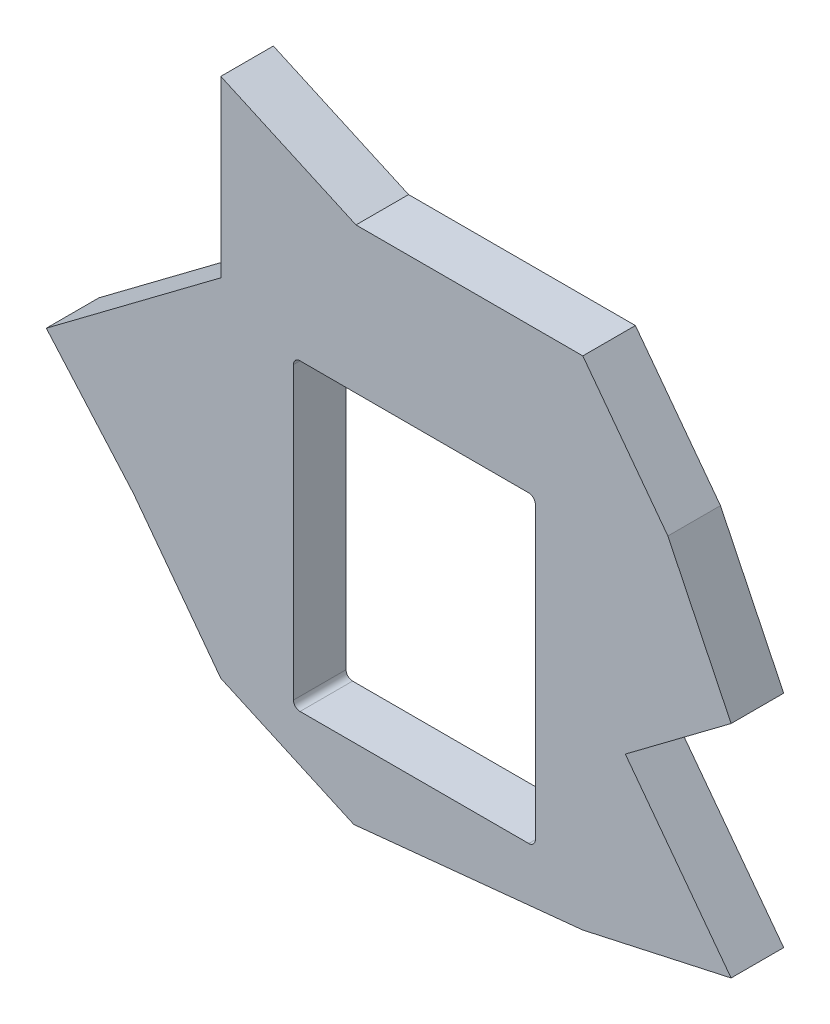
ISO-10303-21;
HEADER;
FILE_DESCRIPTION(('STEP AP214'),'2;1');
FILE_NAME('part.step','',(''),(''),'','','');
FILE_SCHEMA(('AUTOMOTIVE_DESIGN { 1 0 10303 214 1 1 1 1 }'));
ENDSEC;
DATA;
#1=APPLICATION_CONTEXT('core data for automotive mechanical design processes');
#2=APPLICATION_PROTOCOL_DEFINITION('international standard','automotive_design',2000,#1);
#3=PRODUCT_CONTEXT('',#1,'mechanical');
#4=PRODUCT('Part','Part','',(#3));
#5=PRODUCT_RELATED_PRODUCT_CATEGORY('part','',(#4));
#6=PRODUCT_DEFINITION_FORMATION('','',#4);
#7=PRODUCT_DEFINITION_CONTEXT('part definition',#1,'design');
#8=PRODUCT_DEFINITION('design','',#6,#7);
#9=PRODUCT_DEFINITION_SHAPE('','',#8);
#10=(LENGTH_UNIT() NAMED_UNIT(*) SI_UNIT(.MILLI.,.METRE.));
#11=(NAMED_UNIT(*) PLANE_ANGLE_UNIT() SI_UNIT($,.RADIAN.));
#12=(NAMED_UNIT(*) SI_UNIT($,.STERADIAN.) SOLID_ANGLE_UNIT());
#13=UNCERTAINTY_MEASURE_WITH_UNIT(LENGTH_MEASURE(1.E-05),#10,'distance_accuracy_value','');
#14=(GEOMETRIC_REPRESENTATION_CONTEXT(3) GLOBAL_UNCERTAINTY_ASSIGNED_CONTEXT((#13)) GLOBAL_UNIT_ASSIGNED_CONTEXT((#10,
#11,#12)) REPRESENTATION_CONTEXT('',''));
#15=CARTESIAN_POINT('',(0.,0.,0.));
#16=DIRECTION('',(0.,0.,1.));
#17=DIRECTION('',(1.,0.,0.));
#18=AXIS2_PLACEMENT_3D('',#15,#16,#17);
#19=CARTESIAN_POINT('',(303.915043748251,-173.8595481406,40.));
#20=DIRECTION('',(0.,0.,1.));
#21=DIRECTION('',(1.,0.,0.));
#22=AXIS2_PLACEMENT_3D('',#19,#20,#21);
#23=PLANE('',#22);
#24=DIRECTION('',(1.,0.,0.));
#25=VECTOR('',#24,1.);
#26=CARTESIAN_POINT('',(-86.9999999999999,-119.85,40.));
#27=LINE('',#26,#25);
#28=CARTESIAN_POINT('',(-86.9999999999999,-119.85,40.));
#29=VERTEX_POINT('',#28);
#30=CARTESIAN_POINT('',(87.0000000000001,-119.85,40.));
#31=VERTEX_POINT('',#30);
#32=EDGE_CURVE('E308',#29,#31,#27,.T.);
#33=ORIENTED_EDGE('',*,*,#32,.F.);
#34=CARTESIAN_POINT('',(-86.9999999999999,-114.85,40.));
#35=DIRECTION('',(0.,0.,1.));
#36=DIRECTION('',(1.,0.,0.));
#37=AXIS2_PLACEMENT_3D('',#34,#35,#36);
#38=CIRCLE('',#37,4.99999999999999);
#39=CARTESIAN_POINT('',(-91.9999999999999,-114.85,40.));
#40=VERTEX_POINT('',#39);
#41=EDGE_CURVE('E306',#40,#29,#38,.T.);
#42=ORIENTED_EDGE('',*,*,#41,.F.);
#43=DIRECTION('',(0.,-1.,0.));
#44=VECTOR('',#43,1.);
#45=CARTESIAN_POINT('',(-92.,106.15,40.));
#46=LINE('',#45,#44);
#47=CARTESIAN_POINT('',(-92.,106.15,40.));
#48=VERTEX_POINT('',#47);
#49=EDGE_CURVE('E321',#48,#40,#46,.T.);
#50=ORIENTED_EDGE('',*,*,#49,.F.);
#51=CARTESIAN_POINT('',(-87.,106.15,40.));
#52=DIRECTION('',(0.,0.,1.));
#53=DIRECTION('',(1.,0.,0.));
#54=AXIS2_PLACEMENT_3D('',#51,#52,#53);
#55=CIRCLE('',#54,4.99999999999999);
#56=CARTESIAN_POINT('',(-87.,111.15,40.));
#57=VERTEX_POINT('',#56);
#58=EDGE_CURVE('E318',#57,#48,#55,.T.);
#59=ORIENTED_EDGE('',*,*,#58,.F.);
#60=DIRECTION('',(-1.,0.,0.));
#61=VECTOR('',#60,1.);
#62=CARTESIAN_POINT('',(87.,111.15,40.));
#63=LINE('',#62,#61);
#64=CARTESIAN_POINT('',(87.,111.15,40.));
#65=VERTEX_POINT('',#64);
#66=EDGE_CURVE('E316',#65,#57,#63,.T.);
#67=ORIENTED_EDGE('',*,*,#66,.F.);
#68=CARTESIAN_POINT('',(87.,106.15,40.));
#69=DIRECTION('',(0.,0.,1.));
#70=DIRECTION('',(1.,0.,0.));
#71=AXIS2_PLACEMENT_3D('',#68,#69,#70);
#72=CIRCLE('',#71,4.99999999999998);
#73=CARTESIAN_POINT('',(92.,106.15,40.));
#74=VERTEX_POINT('',#73);
#75=EDGE_CURVE('E314',#74,#65,#72,.T.);
#76=ORIENTED_EDGE('',*,*,#75,.F.);
#77=DIRECTION('',(0.,1.,0.));
#78=VECTOR('',#77,1.);
#79=CARTESIAN_POINT('',(92.0000000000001,-114.85,40.));
#80=LINE('',#79,#78);
#81=CARTESIAN_POINT('',(92.0000000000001,-114.85,40.));
#82=VERTEX_POINT('',#81);
#83=EDGE_CURVE('E312',#82,#74,#80,.T.);
#84=ORIENTED_EDGE('',*,*,#83,.F.);
#85=CARTESIAN_POINT('',(87.0000000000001,-114.85,40.));
#86=DIRECTION('',(0.,0.,1.));
#87=DIRECTION('',(1.,0.,0.));
#88=AXIS2_PLACEMENT_3D('',#85,#86,#87);
#89=CIRCLE('',#88,5.);
#90=EDGE_CURVE('E310',#31,#82,#89,.T.);
#91=ORIENTED_EDGE('',*,*,#90,.F.);
#92=EDGE_LOOP('',(#33,#42,#50,#59,#67,#76,#84,#91));
#93=FACE_BOUND('',#92,.T.);
#94=DIRECTION('',(0.8,0.6,0.));
#95=VECTOR('',#94,1.);
#96=CARTESIAN_POINT('',(-280.021607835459,36.147993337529,40.));
#97=LINE('',#96,#95);
#98=CARTESIAN_POINT('',(-280.021607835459,36.1479933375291,40.));
#99=VERTEX_POINT('',#98);
#100=CARTESIAN_POINT('',(-147.291592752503,135.695504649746,40.));
#101=VERTEX_POINT('',#100);
#102=EDGE_CURVE('E227',#99,#101,#97,.T.);
#103=ORIENTED_EDGE('',*,*,#102,.F.);
#104=DIRECTION('',(-0.658657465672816,0.75244291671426,0.));
#105=VECTOR('',#104,1.);
#106=CARTESIAN_POINT('',(-213.656600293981,-39.6666484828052,40.));
#107=LINE('',#106,#105);
#108=CARTESIAN_POINT('',(-213.656600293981,-39.6666484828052,40.));
#109=VERTEX_POINT('',#108);
#110=EDGE_CURVE('E46',#109,#99,#107,.T.);
#111=ORIENTED_EDGE('',*,*,#110,.F.);
#112=DIRECTION('',(-0.6,0.8,0.));
#113=VECTOR('',#112,1.);
#114=CARTESIAN_POINT('',(-147.291592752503,-128.153325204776,40.));
#115=LINE('',#114,#113);
#116=CARTESIAN_POINT('',(-147.291592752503,-128.153325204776,40.));
#117=VERTEX_POINT('',#116);
#118=EDGE_CURVE('E257',#117,#109,#115,.T.);
#119=ORIENTED_EDGE('',*,*,#118,.F.);
#120=DIRECTION('',(-0.911370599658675,0.411586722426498,0.));
#121=VECTOR('',#120,1.);
#122=CARTESIAN_POINT('',(-46.084956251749,-173.8595481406,40.));
#123=LINE('',#122,#121);
#124=CARTESIAN_POINT('',(-46.084956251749,-173.8595481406,40.));
#125=VERTEX_POINT('',#124);
#126=EDGE_CURVE('E254',#125,#117,#123,.T.);
#127=ORIENTED_EDGE('',*,*,#126,.F.);
#128=DIRECTION('',(-0.994964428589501,-0.100228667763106,0.));
#129=VECTOR('',#128,1.);
#130=CARTESIAN_POINT('',(128.123188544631,-156.310528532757,40.));
#131=LINE('',#130,#129);
#132=CARTESIAN_POINT('',(128.123188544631,-156.310528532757,40.));
#133=VERTEX_POINT('',#132);
#134=EDGE_CURVE('E251',#133,#125,#131,.T.);
#135=ORIENTED_EDGE('',*,*,#134,.F.);
#136=DIRECTION('',(-0.976649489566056,-0.214838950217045,0.));
#137=VECTOR('',#136,1.);
#138=CARTESIAN_POINT('',(240.943701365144,-131.492780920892,40.));
#139=LINE('',#138,#137);
#140=CARTESIAN_POINT('',(240.943701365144,-131.492780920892,40.));
#141=VERTEX_POINT('',#140);
#142=EDGE_CURVE('E248',#141,#133,#139,.T.);
#143=ORIENTED_EDGE('',*,*,#142,.F.);
#144=DIRECTION('',(0.6,-0.8,0.));
#145=VECTOR('',#144,1.);
#146=CARTESIAN_POINT('',(160.476129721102,-24.2026853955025,40.));
#147=LINE('',#146,#145);
#148=CARTESIAN_POINT('',(160.476129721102,-24.2026853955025,40.));
#149=VERTEX_POINT('',#148);
#150=EDGE_CURVE('E245',#149,#141,#147,.T.);
#151=ORIENTED_EDGE('',*,*,#150,.F.);
#152=DIRECTION('',(-0.8,-0.6,0.));
#153=VECTOR('',#152,1.);
#154=CARTESIAN_POINT('',(240.943701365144,36.147993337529,40.));
#155=LINE('',#154,#153);
#156=CARTESIAN_POINT('',(240.943701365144,36.147993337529,40.));
#157=VERTEX_POINT('',#156);
#158=EDGE_CURVE('E242',#157,#149,#155,.T.);
#159=ORIENTED_EDGE('',*,*,#158,.F.);
#160=DIRECTION('',(0.435168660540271,-0.900348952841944,0.));
#161=VECTOR('',#160,1.);
#162=CARTESIAN_POINT('',(192.829070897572,135.695504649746,40.));
#163=LINE('',#162,#161);
#164=CARTESIAN_POINT('',(192.829070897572,135.695504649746,40.));
#165=VERTEX_POINT('',#164);
#166=EDGE_CURVE('E239',#165,#157,#163,.T.);
#167=ORIENTED_EDGE('',*,*,#166,.F.);
#168=DIRECTION('',(0.6,-0.8,0.));
#169=VECTOR('',#168,1.);
#170=CARTESIAN_POINT('',(128.123188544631,221.970014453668,40.));
#171=LINE('',#170,#169);
#172=CARTESIAN_POINT('',(128.123188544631,221.970014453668,40.));
#173=VERTEX_POINT('',#172);
#174=EDGE_CURVE('E236',#173,#165,#171,.T.);
#175=ORIENTED_EDGE('',*,*,#174,.F.);
#176=DIRECTION('',(1.,0.,0.));
#177=VECTOR('',#176,1.);
#178=CARTESIAN_POINT('',(-44.4258310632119,221.970014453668,40.));
#179=LINE('',#178,#177);
#180=CARTESIAN_POINT('',(-44.4258310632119,221.970014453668,40.));
#181=VERTEX_POINT('',#180);
#182=EDGE_CURVE('E233',#181,#173,#179,.T.);
#183=ORIENTED_EDGE('',*,*,#182,.F.);
#184=DIRECTION('',(0.911370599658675,-0.411586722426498,0.));
#185=VECTOR('',#184,1.);
#186=CARTESIAN_POINT('',(-147.291592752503,268.425519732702,40.));
#187=LINE('',#186,#185);
#188=CARTESIAN_POINT('',(-147.291592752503,268.425519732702,40.));
#189=VERTEX_POINT('',#188);
#190=EDGE_CURVE('E231',#189,#181,#187,.T.);
#191=ORIENTED_EDGE('',*,*,#190,.F.);
#192=DIRECTION('',(0.,1.,0.));
#193=VECTOR('',#192,1.);
#194=CARTESIAN_POINT('',(-147.291592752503,135.695504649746,40.));
#195=LINE('',#194,#193);
#196=EDGE_CURVE('E176',#101,#189,#195,.T.);
#197=ORIENTED_EDGE('',*,*,#196,.F.);
#198=EDGE_LOOP('',(#103,#111,#119,#127,#135,#143,#151,#159,#167,#175,#183,#191,#197));
#199=FACE_BOUND('',#198,.T.);
#200=ADVANCED_FACE('F32',(#93,#199),#23,.T.);
#201=CARTESIAN_POINT('',(303.915043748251,-173.8595481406,0.));
#202=DIRECTION('',(0.,0.,1.));
#203=DIRECTION('',(1.,0.,0.));
#204=AXIS2_PLACEMENT_3D('',#201,#202,#203);
#205=PLANE('',#204);
#206=CARTESIAN_POINT('',(-86.9999999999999,-114.85,0.));
#207=DIRECTION('',(0.,0.,1.));
#208=DIRECTION('',(1.,0.,0.));
#209=AXIS2_PLACEMENT_3D('',#206,#207,#208);
#210=CIRCLE('',#209,4.99999999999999);
#211=CARTESIAN_POINT('',(-91.9999999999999,-114.85,0.));
#212=VERTEX_POINT('',#211);
#213=CARTESIAN_POINT('',(-86.9999999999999,-119.85,0.));
#214=VERTEX_POINT('',#213);
#215=EDGE_CURVE('E263',#212,#214,#210,.T.);
#216=ORIENTED_EDGE('',*,*,#215,.T.);
#217=DIRECTION('',(1.,0.,0.));
#218=VECTOR('',#217,1.);
#219=CARTESIAN_POINT('',(-86.9999999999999,-119.85,0.));
#220=LINE('',#219,#218);
#221=CARTESIAN_POINT('',(87.0000000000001,-119.85,0.));
#222=VERTEX_POINT('',#221);
#223=EDGE_CURVE('E285',#214,#222,#220,.T.);
#224=ORIENTED_EDGE('',*,*,#223,.T.);
#225=CARTESIAN_POINT('',(87.0000000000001,-114.85,0.));
#226=DIRECTION('',(0.,0.,1.));
#227=DIRECTION('',(1.,0.,0.));
#228=AXIS2_PLACEMENT_3D('',#225,#226,#227);
#229=CIRCLE('',#228,5.);
#230=CARTESIAN_POINT('',(92.0000000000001,-114.85,0.));
#231=VERTEX_POINT('',#230);
#232=EDGE_CURVE('E288',#222,#231,#229,.T.);
#233=ORIENTED_EDGE('',*,*,#232,.T.);
#234=DIRECTION('',(0.,1.,0.));
#235=VECTOR('',#234,1.);
#236=CARTESIAN_POINT('',(92.0000000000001,-114.85,0.));
#237=LINE('',#236,#235);
#238=CARTESIAN_POINT('',(92.,106.15,0.));
#239=VERTEX_POINT('',#238);
#240=EDGE_CURVE('E291',#231,#239,#237,.T.);
#241=ORIENTED_EDGE('',*,*,#240,.T.);
#242=CARTESIAN_POINT('',(87.,106.15,0.));
#243=DIRECTION('',(0.,0.,1.));
#244=DIRECTION('',(1.,0.,0.));
#245=AXIS2_PLACEMENT_3D('',#242,#243,#244);
#246=CIRCLE('',#245,4.99999999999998);
#247=CARTESIAN_POINT('',(87.,111.15,0.));
#248=VERTEX_POINT('',#247);
#249=EDGE_CURVE('E294',#239,#248,#246,.T.);
#250=ORIENTED_EDGE('',*,*,#249,.T.);
#251=DIRECTION('',(-1.,0.,0.));
#252=VECTOR('',#251,1.);
#253=CARTESIAN_POINT('',(87.,111.15,0.));
#254=LINE('',#253,#252);
#255=CARTESIAN_POINT('',(-87.,111.15,0.));
#256=VERTEX_POINT('',#255);
#257=EDGE_CURVE('E297',#248,#256,#254,.T.);
#258=ORIENTED_EDGE('',*,*,#257,.T.);
#259=CARTESIAN_POINT('',(-87.,106.15,0.));
#260=DIRECTION('',(0.,0.,1.));
#261=DIRECTION('',(1.,0.,0.));
#262=AXIS2_PLACEMENT_3D('',#259,#260,#261);
#263=CIRCLE('',#262,4.99999999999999);
#264=CARTESIAN_POINT('',(-92.,106.15,0.));
#265=VERTEX_POINT('',#264);
#266=EDGE_CURVE('E300',#256,#265,#263,.T.);
#267=ORIENTED_EDGE('',*,*,#266,.T.);
#268=DIRECTION('',(0.,-1.,0.));
#269=VECTOR('',#268,1.);
#270=CARTESIAN_POINT('',(-92.,106.15,0.));
#271=LINE('',#270,#269);
#272=EDGE_CURVE('E303',#265,#212,#271,.T.);
#273=ORIENTED_EDGE('',*,*,#272,.T.);
#274=EDGE_LOOP('',(#216,#224,#233,#241,#250,#258,#267,#273));
#275=FACE_BOUND('',#274,.T.);
#276=DIRECTION('',(-0.658657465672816,0.75244291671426,0.));
#277=VECTOR('',#276,1.);
#278=CARTESIAN_POINT('',(-213.656600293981,-39.6666484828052,0.));
#279=LINE('',#278,#277);
#280=CARTESIAN_POINT('',(-213.656600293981,-39.6666484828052,0.));
#281=VERTEX_POINT('',#280);
#282=CARTESIAN_POINT('',(-280.021607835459,36.1479933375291,0.));
#283=VERTEX_POINT('',#282);
#284=EDGE_CURVE('E197',#281,#283,#279,.T.);
#285=ORIENTED_EDGE('',*,*,#284,.T.);
#286=DIRECTION('',(0.8,0.6,0.));
#287=VECTOR('',#286,1.);
#288=CARTESIAN_POINT('',(-280.021607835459,36.147993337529,0.));
#289=LINE('',#288,#287);
#290=CARTESIAN_POINT('',(-147.291592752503,135.695504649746,0.));
#291=VERTEX_POINT('',#290);
#292=EDGE_CURVE('E195',#283,#291,#289,.T.);
#293=ORIENTED_EDGE('',*,*,#292,.T.);
#294=DIRECTION('',(0.,1.,0.));
#295=VECTOR('',#294,1.);
#296=CARTESIAN_POINT('',(-147.291592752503,135.695504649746,0.));
#297=LINE('',#296,#295);
#298=CARTESIAN_POINT('',(-147.291592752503,268.425519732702,0.));
#299=VERTEX_POINT('',#298);
#300=EDGE_CURVE('E54',#291,#299,#297,.T.);
#301=ORIENTED_EDGE('',*,*,#300,.T.);
#302=DIRECTION('',(0.911370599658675,-0.411586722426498,0.));
#303=VECTOR('',#302,1.);
#304=CARTESIAN_POINT('',(-147.291592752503,268.425519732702,0.));
#305=LINE('',#304,#303);
#306=CARTESIAN_POINT('',(-44.4258310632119,221.970014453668,0.));
#307=VERTEX_POINT('',#306);
#308=EDGE_CURVE('E184',#299,#307,#305,.T.);
#309=ORIENTED_EDGE('',*,*,#308,.T.);
#310=DIRECTION('',(1.,0.,0.));
#311=VECTOR('',#310,1.);
#312=CARTESIAN_POINT('',(-44.4258310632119,221.970014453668,0.));
#313=LINE('',#312,#311);
#314=CARTESIAN_POINT('',(128.123188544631,221.970014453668,0.));
#315=VERTEX_POINT('',#314);
#316=EDGE_CURVE('E189',#307,#315,#313,.T.);
#317=ORIENTED_EDGE('',*,*,#316,.T.);
#318=DIRECTION('',(0.6,-0.8,0.));
#319=VECTOR('',#318,1.);
#320=CARTESIAN_POINT('',(128.123188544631,221.970014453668,0.));
#321=LINE('',#320,#319);
#322=CARTESIAN_POINT('',(192.829070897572,135.695504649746,0.));
#323=VERTEX_POINT('',#322);
#324=EDGE_CURVE('E202',#315,#323,#321,.T.);
#325=ORIENTED_EDGE('',*,*,#324,.T.);
#326=DIRECTION('',(0.435168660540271,-0.900348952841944,0.));
#327=VECTOR('',#326,1.);
#328=CARTESIAN_POINT('',(192.829070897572,135.695504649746,0.));
#329=LINE('',#328,#327);
#330=CARTESIAN_POINT('',(240.943701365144,36.147993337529,0.));
#331=VERTEX_POINT('',#330);
#332=EDGE_CURVE('E205',#323,#331,#329,.T.);
#333=ORIENTED_EDGE('',*,*,#332,.T.);
#334=DIRECTION('',(-0.8,-0.6,0.));
#335=VECTOR('',#334,1.);
#336=CARTESIAN_POINT('',(240.943701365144,36.147993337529,0.));
#337=LINE('',#336,#335);
#338=CARTESIAN_POINT('',(160.476129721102,-24.2026853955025,0.));
#339=VERTEX_POINT('',#338);
#340=EDGE_CURVE('E208',#331,#339,#337,.T.);
#341=ORIENTED_EDGE('',*,*,#340,.T.);
#342=DIRECTION('',(0.6,-0.8,0.));
#343=VECTOR('',#342,1.);
#344=CARTESIAN_POINT('',(160.476129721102,-24.2026853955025,0.));
#345=LINE('',#344,#343);
#346=CARTESIAN_POINT('',(240.943701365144,-131.492780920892,0.));
#347=VERTEX_POINT('',#346);
#348=EDGE_CURVE('E211',#339,#347,#345,.T.);
#349=ORIENTED_EDGE('',*,*,#348,.T.);
#350=DIRECTION('',(-0.976649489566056,-0.214838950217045,0.));
#351=VECTOR('',#350,1.);
#352=CARTESIAN_POINT('',(240.943701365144,-131.492780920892,0.));
#353=LINE('',#352,#351);
#354=CARTESIAN_POINT('',(128.123188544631,-156.310528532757,0.));
#355=VERTEX_POINT('',#354);
#356=EDGE_CURVE('E214',#347,#355,#353,.T.);
#357=ORIENTED_EDGE('',*,*,#356,.T.);
#358=DIRECTION('',(-0.994964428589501,-0.100228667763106,0.));
#359=VECTOR('',#358,1.);
#360=CARTESIAN_POINT('',(128.123188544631,-156.310528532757,0.));
#361=LINE('',#360,#359);
#362=CARTESIAN_POINT('',(-46.084956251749,-173.8595481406,0.));
#363=VERTEX_POINT('',#362);
#364=EDGE_CURVE('E217',#355,#363,#361,.T.);
#365=ORIENTED_EDGE('',*,*,#364,.T.);
#366=DIRECTION('',(-0.911370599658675,0.411586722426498,0.));
#367=VECTOR('',#366,1.);
#368=CARTESIAN_POINT('',(-46.084956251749,-173.8595481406,0.));
#369=LINE('',#368,#367);
#370=CARTESIAN_POINT('',(-147.291592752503,-128.153325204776,0.));
#371=VERTEX_POINT('',#370);
#372=EDGE_CURVE('E220',#363,#371,#369,.T.);
#373=ORIENTED_EDGE('',*,*,#372,.T.);
#374=DIRECTION('',(-0.6,0.8,0.));
#375=VECTOR('',#374,1.);
#376=CARTESIAN_POINT('',(-147.291592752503,-128.153325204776,0.));
#377=LINE('',#376,#375);
#378=EDGE_CURVE('E223',#371,#281,#377,.T.);
#379=ORIENTED_EDGE('',*,*,#378,.T.);
#380=EDGE_LOOP('',(#285,#293,#301,#309,#317,#325,#333,#341,#349,#357,#365,#373,#379));
#381=FACE_BOUND('',#380,.T.);
#382=ADVANCED_FACE('F193',(#275,#381),#205,.F.);
#383=CARTESIAN_POINT('',(-86.9999999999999,-114.85,40.));
#384=DIRECTION('',(0.,0.,-1.));
#385=DIRECTION('',(-1.,0.,0.));
#386=AXIS2_PLACEMENT_3D('',#383,#384,#385);
#387=CYLINDRICAL_SURFACE('',#386,4.99999999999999);
#388=ORIENTED_EDGE('',*,*,#215,.F.);
#389=DIRECTION('',(0.,0.,-1.));
#390=VECTOR('',#389,1.);
#391=CARTESIAN_POINT('',(-91.9999999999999,-114.85,40.));
#392=LINE('',#391,#390);
#393=EDGE_CURVE('E323',#40,#212,#392,.T.);
#394=ORIENTED_EDGE('',*,*,#393,.F.);
#395=ORIENTED_EDGE('',*,*,#41,.T.);
#396=DIRECTION('',(0.,0.,-1.));
#397=VECTOR('',#396,1.);
#398=CARTESIAN_POINT('',(-86.9999999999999,-119.85,40.));
#399=LINE('',#398,#397);
#400=EDGE_CURVE('E12',#29,#214,#399,.T.);
#401=ORIENTED_EDGE('',*,*,#400,.T.);
#402=EDGE_LOOP('',(#388,#394,#395,#401));
#403=FACE_BOUND('',#402,.T.);
#404=ADVANCED_FACE('F350',(#403),#387,.F.);
#405=CARTESIAN_POINT('',(-86.9999999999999,-119.85,40.));
#406=DIRECTION('',(0.,1.,0.));
#407=DIRECTION('',(0.,0.,1.));
#408=AXIS2_PLACEMENT_3D('',#405,#406,#407);
#409=PLANE('',#408);
#410=ORIENTED_EDGE('',*,*,#223,.F.);
#411=ORIENTED_EDGE('',*,*,#400,.F.);
#412=ORIENTED_EDGE('',*,*,#32,.T.);
#413=DIRECTION('',(0.,0.,-1.));
#414=VECTOR('',#413,1.);
#415=CARTESIAN_POINT('',(87.0000000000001,-119.85,40.));
#416=LINE('',#415,#414);
#417=EDGE_CURVE('E39',#31,#222,#416,.T.);
#418=ORIENTED_EDGE('',*,*,#417,.T.);
#419=EDGE_LOOP('',(#410,#411,#412,#418));
#420=FACE_BOUND('',#419,.T.);
#421=ADVANCED_FACE('F338',(#420),#409,.T.);
#422=CARTESIAN_POINT('',(87.0000000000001,-114.85,40.));
#423=DIRECTION('',(0.,0.,-1.));
#424=DIRECTION('',(-1.,0.,0.));
#425=AXIS2_PLACEMENT_3D('',#422,#423,#424);
#426=CYLINDRICAL_SURFACE('',#425,5.);
#427=ORIENTED_EDGE('',*,*,#232,.F.);
#428=ORIENTED_EDGE('',*,*,#417,.F.);
#429=ORIENTED_EDGE('',*,*,#90,.T.);
#430=DIRECTION('',(0.,0.,-1.));
#431=VECTOR('',#430,1.);
#432=CARTESIAN_POINT('',(92.0000000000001,-114.85,40.));
#433=LINE('',#432,#431);
#434=EDGE_CURVE('E334',#82,#231,#433,.T.);
#435=ORIENTED_EDGE('',*,*,#434,.T.);
#436=EDGE_LOOP('',(#427,#428,#429,#435));
#437=FACE_BOUND('',#436,.T.);
#438=ADVANCED_FACE('F343',(#437),#426,.F.);
#439=CARTESIAN_POINT('',(92.0000000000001,-114.85,40.));
#440=DIRECTION('',(-1.,0.,0.));
#441=DIRECTION('',(0.,-1.,0.));
#442=AXIS2_PLACEMENT_3D('',#439,#440,#441);
#443=PLANE('',#442);
#444=ORIENTED_EDGE('',*,*,#240,.F.);
#445=ORIENTED_EDGE('',*,*,#434,.F.);
#446=ORIENTED_EDGE('',*,*,#83,.T.);
#447=DIRECTION('',(0.,0.,-1.));
#448=VECTOR('',#447,1.);
#449=CARTESIAN_POINT('',(92.,106.15,40.));
#450=LINE('',#449,#448);
#451=EDGE_CURVE('E332',#74,#239,#450,.T.);
#452=ORIENTED_EDGE('',*,*,#451,.T.);
#453=EDGE_LOOP('',(#444,#445,#446,#452));
#454=FACE_BOUND('',#453,.T.);
#455=ADVANCED_FACE('F362',(#454),#443,.T.);
#456=CARTESIAN_POINT('',(87.,106.15,40.));
#457=DIRECTION('',(0.,0.,-1.));
#458=DIRECTION('',(-1.,0.,0.));
#459=AXIS2_PLACEMENT_3D('',#456,#457,#458);
#460=CYLINDRICAL_SURFACE('',#459,4.99999999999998);
#461=ORIENTED_EDGE('',*,*,#249,.F.);
#462=ORIENTED_EDGE('',*,*,#451,.F.);
#463=ORIENTED_EDGE('',*,*,#75,.T.);
#464=DIRECTION('',(0.,0.,-1.));
#465=VECTOR('',#464,1.);
#466=CARTESIAN_POINT('',(87.,111.15,40.));
#467=LINE('',#466,#465);
#468=EDGE_CURVE('E330',#65,#248,#467,.T.);
#469=ORIENTED_EDGE('',*,*,#468,.T.);
#470=EDGE_LOOP('',(#461,#462,#463,#469));
#471=FACE_BOUND('',#470,.T.);
#472=ADVANCED_FACE('F367',(#471),#460,.F.);
#473=CARTESIAN_POINT('',(87.,111.15,40.));
#474=DIRECTION('',(0.,-1.,0.));
#475=DIRECTION('',(0.,0.,-1.));
#476=AXIS2_PLACEMENT_3D('',#473,#474,#475);
#477=PLANE('',#476);
#478=ORIENTED_EDGE('',*,*,#257,.F.);
#479=ORIENTED_EDGE('',*,*,#468,.F.);
#480=ORIENTED_EDGE('',*,*,#66,.T.);
#481=DIRECTION('',(0.,0.,-1.));
#482=VECTOR('',#481,1.);
#483=CARTESIAN_POINT('',(-87.,111.15,40.));
#484=LINE('',#483,#482);
#485=EDGE_CURVE('E328',#57,#256,#484,.T.);
#486=ORIENTED_EDGE('',*,*,#485,.T.);
#487=EDGE_LOOP('',(#478,#479,#480,#486));
#488=FACE_BOUND('',#487,.T.);
#489=ADVANCED_FACE('F370',(#488),#477,.T.);
#490=CARTESIAN_POINT('',(-87.,106.15,40.));
#491=DIRECTION('',(0.,0.,-1.));
#492=DIRECTION('',(-1.,0.,0.));
#493=AXIS2_PLACEMENT_3D('',#490,#491,#492);
#494=CYLINDRICAL_SURFACE('',#493,4.99999999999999);
#495=ORIENTED_EDGE('',*,*,#266,.F.);
#496=ORIENTED_EDGE('',*,*,#485,.F.);
#497=ORIENTED_EDGE('',*,*,#58,.T.);
#498=DIRECTION('',(0.,0.,-1.));
#499=VECTOR('',#498,1.);
#500=CARTESIAN_POINT('',(-92.,106.15,40.));
#501=LINE('',#500,#499);
#502=EDGE_CURVE('E326',#48,#265,#501,.T.);
#503=ORIENTED_EDGE('',*,*,#502,.T.);
#504=EDGE_LOOP('',(#495,#496,#497,#503));
#505=FACE_BOUND('',#504,.T.);
#506=ADVANCED_FACE('F374',(#505),#494,.F.);
#507=CARTESIAN_POINT('',(-92.,106.15,40.));
#508=DIRECTION('',(1.,0.,0.));
#509=DIRECTION('',(0.,1.,0.));
#510=AXIS2_PLACEMENT_3D('',#507,#508,#509);
#511=PLANE('',#510);
#512=ORIENTED_EDGE('',*,*,#272,.F.);
#513=ORIENTED_EDGE('',*,*,#502,.F.);
#514=ORIENTED_EDGE('',*,*,#49,.T.);
#515=ORIENTED_EDGE('',*,*,#393,.T.);
#516=EDGE_LOOP('',(#512,#513,#514,#515));
#517=FACE_BOUND('',#516,.T.);
#518=ADVANCED_FACE('F353',(#517),#511,.T.);
#519=CARTESIAN_POINT('',(-213.656600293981,-39.6666484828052,40.));
#520=DIRECTION('',(-0.75244291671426,-0.658657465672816,0.));
#521=DIRECTION('',(0.658657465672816,-0.75244291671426,0.));
#522=AXIS2_PLACEMENT_3D('',#519,#520,#521);
#523=PLANE('',#522);
#524=ORIENTED_EDGE('',*,*,#284,.F.);
#525=DIRECTION('',(0.,0.,-1.));
#526=VECTOR('',#525,1.);
#527=CARTESIAN_POINT('',(-213.656600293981,-39.6666484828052,40.));
#528=LINE('',#527,#526);
#529=EDGE_CURVE('E261',#109,#281,#528,.T.);
#530=ORIENTED_EDGE('',*,*,#529,.F.);
#531=ORIENTED_EDGE('',*,*,#110,.T.);
#532=DIRECTION('',(0.,0.,-1.));
#533=VECTOR('',#532,1.);
#534=CARTESIAN_POINT('',(-280.021607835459,36.147993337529,40.));
#535=LINE('',#534,#533);
#536=EDGE_CURVE('E260',#99,#283,#535,.T.);
#537=ORIENTED_EDGE('',*,*,#536,.T.);
#538=EDGE_LOOP('',(#524,#530,#531,#537));
#539=FACE_BOUND('',#538,.T.);
#540=ADVANCED_FACE('F381',(#539),#523,.T.);
#541=CARTESIAN_POINT('',(-147.291592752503,-128.153325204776,40.));
#542=DIRECTION('',(-0.8,-0.6,0.));
#543=DIRECTION('',(0.6,-0.8,0.));
#544=AXIS2_PLACEMENT_3D('',#541,#542,#543);
#545=PLANE('',#544);
#546=ORIENTED_EDGE('',*,*,#378,.F.);
#547=DIRECTION('',(0.,0.,-1.));
#548=VECTOR('',#547,1.);
#549=CARTESIAN_POINT('',(-147.291592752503,-128.153325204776,40.));
#550=LINE('',#549,#548);
#551=EDGE_CURVE('E264',#117,#371,#550,.T.);
#552=ORIENTED_EDGE('',*,*,#551,.F.);
#553=ORIENTED_EDGE('',*,*,#118,.T.);
#554=ORIENTED_EDGE('',*,*,#529,.T.);
#555=EDGE_LOOP('',(#546,#552,#553,#554));
#556=FACE_BOUND('',#555,.T.);
#557=ADVANCED_FACE('F425',(#556),#545,.T.);
#558=CARTESIAN_POINT('',(-46.084956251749,-173.8595481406,40.));
#559=DIRECTION('',(-0.411586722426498,-0.911370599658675,0.));
#560=DIRECTION('',(0.911370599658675,-0.411586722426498,0.));
#561=AXIS2_PLACEMENT_3D('',#558,#559,#560);
#562=PLANE('',#561);
#563=ORIENTED_EDGE('',*,*,#372,.F.);
#564=DIRECTION('',(0.,0.,-1.));
#565=VECTOR('',#564,1.);
#566=CARTESIAN_POINT('',(-46.084956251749,-173.8595481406,40.));
#567=LINE('',#566,#565);
#568=EDGE_CURVE('E266',#125,#363,#567,.T.);
#569=ORIENTED_EDGE('',*,*,#568,.F.);
#570=ORIENTED_EDGE('',*,*,#126,.T.);
#571=ORIENTED_EDGE('',*,*,#551,.T.);
#572=EDGE_LOOP('',(#563,#569,#570,#571));
#573=FACE_BOUND('',#572,.T.);
#574=ADVANCED_FACE('F432',(#573),#562,.T.);
#575=CARTESIAN_POINT('',(128.123188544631,-156.310528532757,40.));
#576=DIRECTION('',(0.100228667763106,-0.994964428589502,0.));
#577=DIRECTION('',(0.994964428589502,0.100228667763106,0.));
#578=AXIS2_PLACEMENT_3D('',#575,#576,#577);
#579=PLANE('',#578);
#580=ORIENTED_EDGE('',*,*,#364,.F.);
#581=DIRECTION('',(0.,0.,-1.));
#582=VECTOR('',#581,1.);
#583=CARTESIAN_POINT('',(128.123188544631,-156.310528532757,40.));
#584=LINE('',#583,#582);
#585=EDGE_CURVE('E268',#133,#355,#584,.T.);
#586=ORIENTED_EDGE('',*,*,#585,.F.);
#587=ORIENTED_EDGE('',*,*,#134,.T.);
#588=ORIENTED_EDGE('',*,*,#568,.T.);
#589=EDGE_LOOP('',(#580,#586,#587,#588));
#590=FACE_BOUND('',#589,.T.);
#591=ADVANCED_FACE('F440',(#590),#579,.T.);
#592=CARTESIAN_POINT('',(240.943701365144,-131.492780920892,40.));
#593=DIRECTION('',(0.214838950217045,-0.976649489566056,0.));
#594=DIRECTION('',(0.976649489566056,0.214838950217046,0.));
#595=AXIS2_PLACEMENT_3D('',#592,#593,#594);
#596=PLANE('',#595);
#597=ORIENTED_EDGE('',*,*,#356,.F.);
#598=DIRECTION('',(0.,0.,-1.));
#599=VECTOR('',#598,1.);
#600=CARTESIAN_POINT('',(240.943701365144,-131.492780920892,40.));
#601=LINE('',#600,#599);
#602=EDGE_CURVE('E270',#141,#347,#601,.T.);
#603=ORIENTED_EDGE('',*,*,#602,.F.);
#604=ORIENTED_EDGE('',*,*,#142,.T.);
#605=ORIENTED_EDGE('',*,*,#585,.T.);
#606=EDGE_LOOP('',(#597,#603,#604,#605));
#607=FACE_BOUND('',#606,.T.);
#608=ADVANCED_FACE('F448',(#607),#596,.T.);
#609=CARTESIAN_POINT('',(160.476129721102,-24.2026853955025,40.));
#610=DIRECTION('',(0.8,0.6,0.));
#611=DIRECTION('',(-0.6,0.8,0.));
#612=AXIS2_PLACEMENT_3D('',#609,#610,#611);
#613=PLANE('',#612);
#614=ORIENTED_EDGE('',*,*,#348,.F.);
#615=DIRECTION('',(0.,0.,-1.));
#616=VECTOR('',#615,1.);
#617=CARTESIAN_POINT('',(160.476129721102,-24.2026853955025,40.));
#618=LINE('',#617,#616);
#619=EDGE_CURVE('E272',#149,#339,#618,.T.);
#620=ORIENTED_EDGE('',*,*,#619,.F.);
#621=ORIENTED_EDGE('',*,*,#150,.T.);
#622=ORIENTED_EDGE('',*,*,#602,.T.);
#623=EDGE_LOOP('',(#614,#620,#621,#622));
#624=FACE_BOUND('',#623,.T.);
#625=ADVANCED_FACE('F456',(#624),#613,.T.);
#626=CARTESIAN_POINT('',(240.943701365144,36.147993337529,40.));
#627=DIRECTION('',(0.6,-0.8,0.));
#628=DIRECTION('',(0.8,0.6,0.));
#629=AXIS2_PLACEMENT_3D('',#626,#627,#628);
#630=PLANE('',#629);
#631=ORIENTED_EDGE('',*,*,#340,.F.);
#632=DIRECTION('',(0.,0.,-1.));
#633=VECTOR('',#632,1.);
#634=CARTESIAN_POINT('',(240.943701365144,36.147993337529,40.));
#635=LINE('',#634,#633);
#636=EDGE_CURVE('E274',#157,#331,#635,.T.);
#637=ORIENTED_EDGE('',*,*,#636,.F.);
#638=ORIENTED_EDGE('',*,*,#158,.T.);
#639=ORIENTED_EDGE('',*,*,#619,.T.);
#640=EDGE_LOOP('',(#631,#637,#638,#639));
#641=FACE_BOUND('',#640,.T.);
#642=ADVANCED_FACE('F464',(#641),#630,.T.);
#643=CARTESIAN_POINT('',(192.829070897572,135.695504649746,40.));
#644=DIRECTION('',(0.900348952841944,0.435168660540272,0.));
#645=DIRECTION('',(-0.435168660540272,0.900348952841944,0.));
#646=AXIS2_PLACEMENT_3D('',#643,#644,#645);
#647=PLANE('',#646);
#648=ORIENTED_EDGE('',*,*,#332,.F.);
#649=DIRECTION('',(0.,0.,-1.));
#650=VECTOR('',#649,1.);
#651=CARTESIAN_POINT('',(192.829070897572,135.695504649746,40.));
#652=LINE('',#651,#650);
#653=EDGE_CURVE('E276',#165,#323,#652,.T.);
#654=ORIENTED_EDGE('',*,*,#653,.F.);
#655=ORIENTED_EDGE('',*,*,#166,.T.);
#656=ORIENTED_EDGE('',*,*,#636,.T.);
#657=EDGE_LOOP('',(#648,#654,#655,#656));
#658=FACE_BOUND('',#657,.T.);
#659=ADVANCED_FACE('F472',(#658),#647,.T.);
#660=CARTESIAN_POINT('',(128.123188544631,221.970014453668,40.));
#661=DIRECTION('',(0.8,0.6,0.));
#662=DIRECTION('',(-0.6,0.8,0.));
#663=AXIS2_PLACEMENT_3D('',#660,#661,#662);
#664=PLANE('',#663);
#665=ORIENTED_EDGE('',*,*,#324,.F.);
#666=DIRECTION('',(0.,0.,-1.));
#667=VECTOR('',#666,1.);
#668=CARTESIAN_POINT('',(128.123188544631,221.970014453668,40.));
#669=LINE('',#668,#667);
#670=EDGE_CURVE('E278',#173,#315,#669,.T.);
#671=ORIENTED_EDGE('',*,*,#670,.F.);
#672=ORIENTED_EDGE('',*,*,#174,.T.);
#673=ORIENTED_EDGE('',*,*,#653,.T.);
#674=EDGE_LOOP('',(#665,#671,#672,#673));
#675=FACE_BOUND('',#674,.T.);
#676=ADVANCED_FACE('F480',(#675),#664,.T.);
#677=CARTESIAN_POINT('',(-44.4258310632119,221.970014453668,40.));
#678=DIRECTION('',(0.,1.,0.));
#679=DIRECTION('',(0.,0.,1.));
#680=AXIS2_PLACEMENT_3D('',#677,#678,#679);
#681=PLANE('',#680);
#682=ORIENTED_EDGE('',*,*,#316,.F.);
#683=DIRECTION('',(0.,0.,-1.));
#684=VECTOR('',#683,1.);
#685=CARTESIAN_POINT('',(-44.4258310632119,221.970014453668,40.));
#686=LINE('',#685,#684);
#687=EDGE_CURVE('E180',#181,#307,#686,.T.);
#688=ORIENTED_EDGE('',*,*,#687,.F.);
#689=ORIENTED_EDGE('',*,*,#182,.T.);
#690=ORIENTED_EDGE('',*,*,#670,.T.);
#691=EDGE_LOOP('',(#682,#688,#689,#690));
#692=FACE_BOUND('',#691,.T.);
#693=ADVANCED_FACE('F488',(#692),#681,.T.);
#694=CARTESIAN_POINT('',(-147.291592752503,268.425519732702,40.));
#695=DIRECTION('',(0.411586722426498,0.911370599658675,0.));
#696=DIRECTION('',(-0.911370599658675,0.411586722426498,0.));
#697=AXIS2_PLACEMENT_3D('',#694,#695,#696);
#698=PLANE('',#697);
#699=ORIENTED_EDGE('',*,*,#308,.F.);
#700=DIRECTION('',(0.,0.,-1.));
#701=VECTOR('',#700,1.);
#702=CARTESIAN_POINT('',(-147.291592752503,268.425519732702,40.));
#703=LINE('',#702,#701);
#704=EDGE_CURVE('E172',#189,#299,#703,.T.);
#705=ORIENTED_EDGE('',*,*,#704,.F.);
#706=ORIENTED_EDGE('',*,*,#190,.T.);
#707=ORIENTED_EDGE('',*,*,#687,.T.);
#708=EDGE_LOOP('',(#699,#705,#706,#707));
#709=FACE_BOUND('',#708,.T.);
#710=ADVANCED_FACE('F185',(#709),#698,.T.);
#711=CARTESIAN_POINT('',(-147.291592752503,135.695504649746,40.));
#712=DIRECTION('',(-1.,0.,0.));
#713=DIRECTION('',(0.,0.,1.));
#714=AXIS2_PLACEMENT_3D('',#711,#712,#713);
#715=PLANE('',#714);
#716=ORIENTED_EDGE('',*,*,#300,.F.);
#717=DIRECTION('',(0.,0.,-1.));
#718=VECTOR('',#717,1.);
#719=CARTESIAN_POINT('',(-147.291592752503,135.695504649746,40.));
#720=LINE('',#719,#718);
#721=EDGE_CURVE('E181',#101,#291,#720,.T.);
#722=ORIENTED_EDGE('',*,*,#721,.F.);
#723=ORIENTED_EDGE('',*,*,#196,.T.);
#724=ORIENTED_EDGE('',*,*,#704,.T.);
#725=EDGE_LOOP('',(#716,#722,#723,#724));
#726=FACE_BOUND('',#725,.T.);
#727=ADVANCED_FACE('F174',(#726),#715,.T.);
#728=CARTESIAN_POINT('',(-280.021607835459,36.147993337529,40.));
#729=DIRECTION('',(-0.6,0.8,0.));
#730=DIRECTION('',(-0.8,-0.6,0.));
#731=AXIS2_PLACEMENT_3D('',#728,#729,#730);
#732=PLANE('',#731);
#733=ORIENTED_EDGE('',*,*,#292,.F.);
#734=ORIENTED_EDGE('',*,*,#536,.F.);
#735=ORIENTED_EDGE('',*,*,#102,.T.);
#736=ORIENTED_EDGE('',*,*,#721,.T.);
#737=EDGE_LOOP('',(#733,#734,#735,#736));
#738=FACE_BOUND('',#737,.T.);
#739=ADVANCED_FACE('F509',(#738),#732,.T.);
#740=CLOSED_SHELL('',(#200,#382,#404,#421,#438,#455,#472,#489,#506,#518,#540,#557,#574,#591,
#608,#625,#642,#659,#676,#693,#710,#727,#739));
#741=MANIFOLD_SOLID_BREP('B2',#740);
#742=ADVANCED_BREP_SHAPE_REPRESENTATION('',(#18,#741),#14);
#743=SHAPE_DEFINITION_REPRESENTATION(#9,#742);
ENDSEC;
END-ISO-10303-21;
